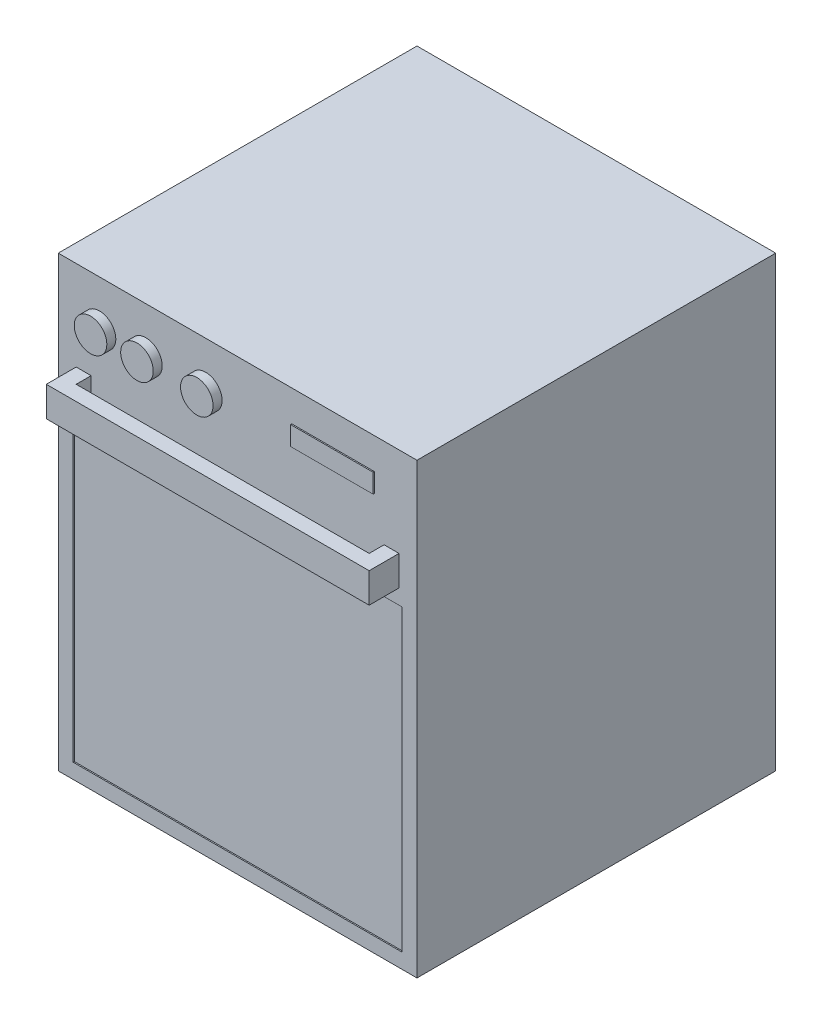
ISO-10303-21;
HEADER;
FILE_DESCRIPTION(('STEP AP214'),'2;1');
FILE_NAME('part.step','',(''),(''),'','','');
FILE_SCHEMA(('AUTOMOTIVE_DESIGN { 1 0 10303 214 1 1 1 1 }'));
ENDSEC;
DATA;
#1=APPLICATION_CONTEXT('core data for automotive mechanical design processes');
#2=APPLICATION_PROTOCOL_DEFINITION('international standard','automotive_design',2000,#1);
#3=PRODUCT_CONTEXT('',#1,'mechanical');
#4=PRODUCT('Part','Part','',(#3));
#5=PRODUCT_RELATED_PRODUCT_CATEGORY('part','',(#4));
#6=PRODUCT_DEFINITION_FORMATION('','',#4);
#7=PRODUCT_DEFINITION_CONTEXT('part definition',#1,'design');
#8=PRODUCT_DEFINITION('design','',#6,#7);
#9=PRODUCT_DEFINITION_SHAPE('','',#8);
#10=(LENGTH_UNIT() NAMED_UNIT(*) SI_UNIT(.MILLI.,.METRE.));
#11=(NAMED_UNIT(*) PLANE_ANGLE_UNIT() SI_UNIT($,.RADIAN.));
#12=(NAMED_UNIT(*) SI_UNIT($,.STERADIAN.) SOLID_ANGLE_UNIT());
#13=UNCERTAINTY_MEASURE_WITH_UNIT(LENGTH_MEASURE(1.E-05),#10,'distance_accuracy_value','');
#14=(GEOMETRIC_REPRESENTATION_CONTEXT(3) GLOBAL_UNCERTAINTY_ASSIGNED_CONTEXT((#13)) GLOBAL_UNIT_ASSIGNED_CONTEXT((#10,
#11,#12)) REPRESENTATION_CONTEXT('',''));
#15=CARTESIAN_POINT('',(0.,0.,0.));
#16=DIRECTION('',(0.,0.,1.));
#17=DIRECTION('',(1.,0.,0.));
#18=AXIS2_PLACEMENT_3D('',#15,#16,#17);
#19=CARTESIAN_POINT('',(0.,0.,600.));
#20=DIRECTION('',(0.,0.,-1.));
#21=DIRECTION('',(-1.,0.,0.));
#22=AXIS2_PLACEMENT_3D('',#19,#20,#21);
#23=PLANE('',#22);
#24=DIRECTION('',(1.,0.,0.));
#25=VECTOR('',#24,1.);
#26=CARTESIAN_POINT('',(30.,550.,600.));
#27=LINE('',#26,#25);
#28=CARTESIAN_POINT('',(545.,550.,600.));
#29=VERTEX_POINT('',#28);
#30=CARTESIAN_POINT('',(570.,550.,600.));
#31=VERTEX_POINT('',#30);
#32=EDGE_CURVE('E278',#29,#31,#27,.T.);
#33=ORIENTED_EDGE('',*,*,#32,.F.);
#34=DIRECTION('',(0.,1.,0.));
#35=VECTOR('',#34,1.);
#36=CARTESIAN_POINT('',(545.,550.,600.));
#37=LINE('',#36,#35);
#38=CARTESIAN_POINT('',(545.,600.,600.));
#39=VERTEX_POINT('',#38);
#40=EDGE_CURVE('E259',#29,#39,#37,.T.);
#41=ORIENTED_EDGE('',*,*,#40,.T.);
#42=DIRECTION('',(-1.,0.,0.));
#43=VECTOR('',#42,1.);
#44=CARTESIAN_POINT('',(30.,600.,600.));
#45=LINE('',#44,#43);
#46=CARTESIAN_POINT('',(570.,600.,600.));
#47=VERTEX_POINT('',#46);
#48=EDGE_CURVE('E269',#47,#39,#45,.T.);
#49=ORIENTED_EDGE('',*,*,#48,.F.);
#50=DIRECTION('',(0.,1.,0.));
#51=VECTOR('',#50,1.);
#52=CARTESIAN_POINT('',(570.,600.,600.));
#53=LINE('',#52,#51);
#54=EDGE_CURVE('E282',#31,#47,#53,.T.);
#55=ORIENTED_EDGE('',*,*,#54,.F.);
#56=EDGE_LOOP('',(#33,#41,#49,#55));
#57=FACE_BOUND('',#56,.T.);
#58=DIRECTION('',(0.,-1.,0.));
#59=VECTOR('',#58,1.);
#60=CARTESIAN_POINT('',(0.,0.,600.));
#61=LINE('',#60,#59);
#62=CARTESIAN_POINT('',(0.,750.,600.));
#63=VERTEX_POINT('',#62);
#64=CARTESIAN_POINT('',(0.,0.,600.));
#65=VERTEX_POINT('',#64);
#66=EDGE_CURVE('E300',#63,#65,#61,.T.);
#67=ORIENTED_EDGE('',*,*,#66,.T.);
#68=DIRECTION('',(1.,0.,0.));
#69=VECTOR('',#68,1.);
#70=CARTESIAN_POINT('',(0.,0.,600.));
#71=LINE('',#70,#69);
#72=CARTESIAN_POINT('',(600.,0.,600.));
#73=VERTEX_POINT('',#72);
#74=EDGE_CURVE('E303',#65,#73,#71,.T.);
#75=ORIENTED_EDGE('',*,*,#74,.T.);
#76=DIRECTION('',(0.,1.,0.));
#77=VECTOR('',#76,1.);
#78=CARTESIAN_POINT('',(600.,0.,600.));
#79=LINE('',#78,#77);
#80=CARTESIAN_POINT('',(600.,750.,600.));
#81=VERTEX_POINT('',#80);
#82=EDGE_CURVE('E306',#73,#81,#79,.T.);
#83=ORIENTED_EDGE('',*,*,#82,.T.);
#84=DIRECTION('',(-1.,0.,0.));
#85=VECTOR('',#84,1.);
#86=CARTESIAN_POINT('',(0.,750.,600.));
#87=LINE('',#86,#85);
#88=EDGE_CURVE('E308',#81,#63,#87,.T.);
#89=ORIENTED_EDGE('',*,*,#88,.T.);
#90=EDGE_LOOP('',(#67,#75,#83,#89));
#91=FACE_BOUND('',#90,.T.);
#92=DIRECTION('',(0.,1.,0.));
#93=VECTOR('',#92,1.);
#94=CARTESIAN_POINT('',(55.,550.,600.));
#95=LINE('',#94,#93);
#96=CARTESIAN_POINT('',(55.,550.,600.));
#97=VERTEX_POINT('',#96);
#98=CARTESIAN_POINT('',(55.,600.,600.));
#99=VERTEX_POINT('',#98);
#100=EDGE_CURVE('E256',#97,#99,#95,.T.);
#101=ORIENTED_EDGE('',*,*,#100,.F.);
#102=CARTESIAN_POINT('',(30.,550.,600.));
#103=VERTEX_POINT('',#102);
#104=EDGE_CURVE('E279',#103,#97,#27,.T.);
#105=ORIENTED_EDGE('',*,*,#104,.F.);
#106=DIRECTION('',(0.,-1.,0.));
#107=VECTOR('',#106,1.);
#108=CARTESIAN_POINT('',(30.,600.,600.));
#109=LINE('',#108,#107);
#110=CARTESIAN_POINT('',(30.,600.,600.));
#111=VERTEX_POINT('',#110);
#112=EDGE_CURVE('E258',#111,#103,#109,.T.);
#113=ORIENTED_EDGE('',*,*,#112,.F.);
#114=EDGE_CURVE('E285',#99,#111,#45,.T.);
#115=ORIENTED_EDGE('',*,*,#114,.F.);
#116=EDGE_LOOP('',(#101,#105,#113,#115));
#117=FACE_BOUND('',#116,.T.);
#118=DIRECTION('',(1.,0.,0.));
#119=VECTOR('',#118,1.);
#120=CARTESIAN_POINT('',(25.,25.,600.));
#121=LINE('',#120,#119);
#122=CARTESIAN_POINT('',(25.,25.,600.));
#123=VERTEX_POINT('',#122);
#124=CARTESIAN_POINT('',(575.,25.,600.));
#125=VERTEX_POINT('',#124);
#126=EDGE_CURVE('E222',#123,#125,#121,.T.);
#127=ORIENTED_EDGE('',*,*,#126,.F.);
#128=DIRECTION('',(0.,-1.,0.));
#129=VECTOR('',#128,1.);
#130=CARTESIAN_POINT('',(25.,525.,600.));
#131=LINE('',#130,#129);
#132=CARTESIAN_POINT('',(25.,525.,600.));
#133=VERTEX_POINT('',#132);
#134=EDGE_CURVE('E206',#133,#123,#131,.T.);
#135=ORIENTED_EDGE('',*,*,#134,.F.);
#136=DIRECTION('',(-1.,0.,0.));
#137=VECTOR('',#136,1.);
#138=CARTESIAN_POINT('',(25.,525.,600.));
#139=LINE('',#138,#137);
#140=CARTESIAN_POINT('',(575.,525.,600.));
#141=VERTEX_POINT('',#140);
#142=EDGE_CURVE('E211',#141,#133,#139,.T.);
#143=ORIENTED_EDGE('',*,*,#142,.F.);
#144=DIRECTION('',(0.,1.,0.));
#145=VECTOR('',#144,1.);
#146=CARTESIAN_POINT('',(575.,525.,600.));
#147=LINE('',#146,#145);
#148=EDGE_CURVE('E225',#125,#141,#147,.T.);
#149=ORIENTED_EDGE('',*,*,#148,.F.);
#150=EDGE_LOOP('',(#127,#135,#143,#149));
#151=FACE_BOUND('',#150,.T.);
#152=CARTESIAN_POINT('',(69.0093748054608,673.512739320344,600.));
#153=DIRECTION('',(0.,0.,-1.));
#154=DIRECTION('',(-1.,0.,0.));
#155=AXIS2_PLACEMENT_3D('',#152,#153,#154);
#156=CIRCLE('',#155,27.2365651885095);
#157=CARTESIAN_POINT('',(41.7728096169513,673.512739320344,600.));
#158=VERTEX_POINT('',#157);
#159=EDGE_CURVE('E329',#158,#158,#156,.F.);
#160=ORIENTED_EDGE('',*,*,#159,.F.);
#161=EDGE_LOOP('',(#160));
#162=FACE_BOUND('',#161,.T.);
#163=CARTESIAN_POINT('',(146.635573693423,673.512739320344,600.));
#164=DIRECTION('',(0.,0.,-1.));
#165=DIRECTION('',(-1.,0.,0.));
#166=AXIS2_PLACEMENT_3D('',#163,#164,#165);
#167=CIRCLE('',#166,27.2365651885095);
#168=CARTESIAN_POINT('',(119.399008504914,673.512739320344,600.));
#169=VERTEX_POINT('',#168);
#170=EDGE_CURVE('E42',#169,#169,#167,.F.);
#171=ORIENTED_EDGE('',*,*,#170,.F.);
#172=EDGE_LOOP('',(#171));
#173=FACE_BOUND('',#172,.T.);
#174=CARTESIAN_POINT('',(246.747834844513,673.512739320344,600.));
#175=DIRECTION('',(0.,0.,-1.));
#176=DIRECTION('',(-1.,0.,0.));
#177=AXIS2_PLACEMENT_3D('',#174,#175,#176);
#178=CIRCLE('',#177,27.2365651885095);
#179=CARTESIAN_POINT('',(219.511269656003,673.512739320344,600.));
#180=VERTEX_POINT('',#179);
#181=EDGE_CURVE('E11',#180,#180,#178,.F.);
#182=ORIENTED_EDGE('',*,*,#181,.F.);
#183=EDGE_LOOP('',(#182));
#184=FACE_BOUND('',#183,.T.);
#185=DIRECTION('',(0.,1.,0.));
#186=VECTOR('',#185,1.);
#187=CARTESIAN_POINT('',(528.716800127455,666.12290980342,600.));
#188=LINE('',#187,#186);
#189=CARTESIAN_POINT('',(528.716800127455,666.12290980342,600.));
#190=VERTEX_POINT('',#189);
#191=CARTESIAN_POINT('',(528.716800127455,697.939027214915,600.));
#192=VERTEX_POINT('',#191);
#193=EDGE_CURVE('E191',#190,#192,#188,.T.);
#194=ORIENTED_EDGE('',*,*,#193,.F.);
#195=DIRECTION('',(1.,0.,0.));
#196=VECTOR('',#195,1.);
#197=CARTESIAN_POINT('',(528.716800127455,666.12290980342,600.));
#198=LINE('',#197,#196);
#199=CARTESIAN_POINT('',(390.332790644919,666.12290980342,600.));
#200=VERTEX_POINT('',#199);
#201=EDGE_CURVE('E188',#200,#190,#198,.T.);
#202=ORIENTED_EDGE('',*,*,#201,.F.);
#203=DIRECTION('',(0.,-1.,0.));
#204=VECTOR('',#203,1.);
#205=CARTESIAN_POINT('',(390.332790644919,666.12290980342,600.));
#206=LINE('',#205,#204);
#207=CARTESIAN_POINT('',(390.332790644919,697.939027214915,600.));
#208=VERTEX_POINT('',#207);
#209=EDGE_CURVE('E54',#208,#200,#206,.T.);
#210=ORIENTED_EDGE('',*,*,#209,.F.);
#211=DIRECTION('',(-1.,0.,0.));
#212=VECTOR('',#211,1.);
#213=CARTESIAN_POINT('',(528.716800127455,697.939027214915,600.));
#214=LINE('',#213,#212);
#215=EDGE_CURVE('E49',#192,#208,#214,.T.);
#216=ORIENTED_EDGE('',*,*,#215,.F.);
#217=EDGE_LOOP('',(#194,#202,#210,#216));
#218=FACE_BOUND('',#217,.T.);
#219=ADVANCED_FACE('F34',(#57,#91,#117,#151,#162,#173,#184,#218),#23,.F.);
#220=CARTESIAN_POINT('',(0.,0.,600.));
#221=DIRECTION('',(1.,0.,0.));
#222=DIRECTION('',(0.,0.,-1.));
#223=AXIS2_PLACEMENT_3D('',#220,#221,#222);
#224=PLANE('',#223);
#225=DIRECTION('',(0.,-1.,0.));
#226=VECTOR('',#225,1.);
#227=CARTESIAN_POINT('',(0.,0.,0.));
#228=LINE('',#227,#226);
#229=CARTESIAN_POINT('',(0.,750.,0.));
#230=VERTEX_POINT('',#229);
#231=CARTESIAN_POINT('',(0.,0.,0.));
#232=VERTEX_POINT('',#231);
#233=EDGE_CURVE('E299',#230,#232,#228,.T.);
#234=ORIENTED_EDGE('',*,*,#233,.T.);
#235=DIRECTION('',(0.,0.,-1.));
#236=VECTOR('',#235,1.);
#237=CARTESIAN_POINT('',(0.,0.,600.));
#238=LINE('',#237,#236);
#239=EDGE_CURVE('E326',#65,#232,#238,.T.);
#240=ORIENTED_EDGE('',*,*,#239,.F.);
#241=ORIENTED_EDGE('',*,*,#66,.F.);
#242=DIRECTION('',(0.,0.,-1.));
#243=VECTOR('',#242,1.);
#244=CARTESIAN_POINT('',(0.,750.,600.));
#245=LINE('',#244,#243);
#246=EDGE_CURVE('E310',#63,#230,#245,.T.);
#247=ORIENTED_EDGE('',*,*,#246,.T.);
#248=EDGE_LOOP('',(#234,#240,#241,#247));
#249=FACE_BOUND('',#248,.T.);
#250=ADVANCED_FACE('F36',(#249),#224,.F.);
#251=CARTESIAN_POINT('',(0.,0.,600.));
#252=DIRECTION('',(0.,1.,0.));
#253=DIRECTION('',(0.,0.,1.));
#254=AXIS2_PLACEMENT_3D('',#251,#252,#253);
#255=PLANE('',#254);
#256=DIRECTION('',(1.,0.,0.));
#257=VECTOR('',#256,1.);
#258=CARTESIAN_POINT('',(0.,0.,0.));
#259=LINE('',#258,#257);
#260=CARTESIAN_POINT('',(600.,0.,0.));
#261=VERTEX_POINT('',#260);
#262=EDGE_CURVE('E313',#232,#261,#259,.T.);
#263=ORIENTED_EDGE('',*,*,#262,.T.);
#264=DIRECTION('',(0.,0.,-1.));
#265=VECTOR('',#264,1.);
#266=CARTESIAN_POINT('',(600.,0.,600.));
#267=LINE('',#266,#265);
#268=EDGE_CURVE('E323',#73,#261,#267,.T.);
#269=ORIENTED_EDGE('',*,*,#268,.F.);
#270=ORIENTED_EDGE('',*,*,#74,.F.);
#271=ORIENTED_EDGE('',*,*,#239,.T.);
#272=EDGE_LOOP('',(#263,#269,#270,#271));
#273=FACE_BOUND('',#272,.T.);
#274=ADVANCED_FACE('F453',(#273),#255,.F.);
#275=CARTESIAN_POINT('',(600.,0.,600.));
#276=DIRECTION('',(-1.,0.,0.));
#277=DIRECTION('',(0.,0.,1.));
#278=AXIS2_PLACEMENT_3D('',#275,#276,#277);
#279=PLANE('',#278);
#280=DIRECTION('',(0.,1.,0.));
#281=VECTOR('',#280,1.);
#282=CARTESIAN_POINT('',(600.,0.,0.));
#283=LINE('',#282,#281);
#284=CARTESIAN_POINT('',(600.,750.,0.));
#285=VERTEX_POINT('',#284);
#286=EDGE_CURVE('E315',#261,#285,#283,.T.);
#287=ORIENTED_EDGE('',*,*,#286,.T.);
#288=DIRECTION('',(0.,0.,-1.));
#289=VECTOR('',#288,1.);
#290=CARTESIAN_POINT('',(600.,750.,600.));
#291=LINE('',#290,#289);
#292=EDGE_CURVE('E320',#81,#285,#291,.T.);
#293=ORIENTED_EDGE('',*,*,#292,.F.);
#294=ORIENTED_EDGE('',*,*,#82,.F.);
#295=ORIENTED_EDGE('',*,*,#268,.T.);
#296=EDGE_LOOP('',(#287,#293,#294,#295));
#297=FACE_BOUND('',#296,.T.);
#298=ADVANCED_FACE('F450',(#297),#279,.F.);
#299=CARTESIAN_POINT('',(0.,750.,600.));
#300=DIRECTION('',(0.,-1.,0.));
#301=DIRECTION('',(0.,0.,-1.));
#302=AXIS2_PLACEMENT_3D('',#299,#300,#301);
#303=PLANE('',#302);
#304=DIRECTION('',(-1.,0.,0.));
#305=VECTOR('',#304,1.);
#306=CARTESIAN_POINT('',(0.,750.,0.));
#307=LINE('',#306,#305);
#308=EDGE_CURVE('E304',#285,#230,#307,.T.);
#309=ORIENTED_EDGE('',*,*,#308,.T.);
#310=ORIENTED_EDGE('',*,*,#246,.F.);
#311=ORIENTED_EDGE('',*,*,#88,.F.);
#312=ORIENTED_EDGE('',*,*,#292,.T.);
#313=EDGE_LOOP('',(#309,#310,#311,#312));
#314=FACE_BOUND('',#313,.T.);
#315=ADVANCED_FACE('F446',(#314),#303,.F.);
#316=CARTESIAN_POINT('',(0.,0.,0.));
#317=DIRECTION('',(0.,0.,-1.));
#318=DIRECTION('',(-1.,0.,0.));
#319=AXIS2_PLACEMENT_3D('',#316,#317,#318);
#320=PLANE('',#319);
#321=ORIENTED_EDGE('',*,*,#233,.F.);
#322=ORIENTED_EDGE('',*,*,#308,.F.);
#323=ORIENTED_EDGE('',*,*,#286,.F.);
#324=ORIENTED_EDGE('',*,*,#262,.F.);
#325=EDGE_LOOP('',(#321,#322,#323,#324));
#326=FACE_BOUND('',#325,.T.);
#327=ADVANCED_FACE('F441',(#326),#320,.T.);
#328=CARTESIAN_POINT('',(30.,600.,650.));
#329=DIRECTION('',(1.,0.,0.));
#330=DIRECTION('',(0.,1.,0.));
#331=AXIS2_PLACEMENT_3D('',#328,#329,#330);
#332=PLANE('',#331);
#333=ORIENTED_EDGE('',*,*,#112,.T.);
#334=DIRECTION('',(0.,0.,-1.));
#335=VECTOR('',#334,1.);
#336=CARTESIAN_POINT('',(30.,550.,650.));
#337=LINE('',#336,#335);
#338=CARTESIAN_POINT('',(30.,550.,650.));
#339=VERTEX_POINT('',#338);
#340=EDGE_CURVE('E296',#339,#103,#337,.T.);
#341=ORIENTED_EDGE('',*,*,#340,.F.);
#342=DIRECTION('',(0.,-1.,0.));
#343=VECTOR('',#342,1.);
#344=CARTESIAN_POINT('',(30.,600.,650.));
#345=LINE('',#344,#343);
#346=CARTESIAN_POINT('',(30.,600.,650.));
#347=VERTEX_POINT('',#346);
#348=EDGE_CURVE('E265',#347,#339,#345,.T.);
#349=ORIENTED_EDGE('',*,*,#348,.F.);
#350=DIRECTION('',(0.,0.,-1.));
#351=VECTOR('',#350,1.);
#352=CARTESIAN_POINT('',(30.,600.,650.));
#353=LINE('',#352,#351);
#354=EDGE_CURVE('E275',#347,#111,#353,.T.);
#355=ORIENTED_EDGE('',*,*,#354,.T.);
#356=EDGE_LOOP('',(#333,#341,#349,#355));
#357=FACE_BOUND('',#356,.T.);
#358=ADVANCED_FACE('F438',(#357),#332,.F.);
#359=CARTESIAN_POINT('',(30.,550.,650.));
#360=DIRECTION('',(0.,1.,0.));
#361=DIRECTION('',(0.,0.,1.));
#362=AXIS2_PLACEMENT_3D('',#359,#360,#361);
#363=PLANE('',#362);
#364=ORIENTED_EDGE('',*,*,#104,.T.);
#365=DIRECTION('',(0.,0.,1.));
#366=VECTOR('',#365,1.);
#367=CARTESIAN_POINT('',(55.,550.,600.));
#368=LINE('',#367,#366);
#369=CARTESIAN_POINT('',(55.,550.,625.));
#370=VERTEX_POINT('',#369);
#371=EDGE_CURVE('E239',#97,#370,#368,.T.);
#372=ORIENTED_EDGE('',*,*,#371,.T.);
#373=DIRECTION('',(1.,0.,0.));
#374=VECTOR('',#373,1.);
#375=CARTESIAN_POINT('',(55.,550.,625.));
#376=LINE('',#375,#374);
#377=CARTESIAN_POINT('',(545.,550.,625.));
#378=VERTEX_POINT('',#377);
#379=EDGE_CURVE('E242',#370,#378,#376,.T.);
#380=ORIENTED_EDGE('',*,*,#379,.T.);
#381=DIRECTION('',(0.,0.,-1.));
#382=VECTOR('',#381,1.);
#383=CARTESIAN_POINT('',(545.,550.,600.));
#384=LINE('',#383,#382);
#385=EDGE_CURVE('E246',#378,#29,#384,.T.);
#386=ORIENTED_EDGE('',*,*,#385,.T.);
#387=ORIENTED_EDGE('',*,*,#32,.T.);
#388=DIRECTION('',(0.,0.,-1.));
#389=VECTOR('',#388,1.);
#390=CARTESIAN_POINT('',(570.,550.,650.));
#391=LINE('',#390,#389);
#392=CARTESIAN_POINT('',(570.,550.,650.));
#393=VERTEX_POINT('',#392);
#394=EDGE_CURVE('E293',#393,#31,#391,.T.);
#395=ORIENTED_EDGE('',*,*,#394,.F.);
#396=DIRECTION('',(1.,0.,0.));
#397=VECTOR('',#396,1.);
#398=CARTESIAN_POINT('',(30.,550.,650.));
#399=LINE('',#398,#397);
#400=EDGE_CURVE('E268',#339,#393,#399,.T.);
#401=ORIENTED_EDGE('',*,*,#400,.F.);
#402=ORIENTED_EDGE('',*,*,#340,.T.);
#403=EDGE_LOOP('',(#364,#372,#380,#386,#387,#395,#401,#402));
#404=FACE_BOUND('',#403,.T.);
#405=ADVANCED_FACE('F434',(#404),#363,.F.);
#406=CARTESIAN_POINT('',(570.,600.,650.));
#407=DIRECTION('',(-1.,0.,0.));
#408=DIRECTION('',(0.,0.,1.));
#409=AXIS2_PLACEMENT_3D('',#406,#407,#408);
#410=PLANE('',#409);
#411=ORIENTED_EDGE('',*,*,#54,.T.);
#412=DIRECTION('',(0.,0.,-1.));
#413=VECTOR('',#412,1.);
#414=CARTESIAN_POINT('',(570.,600.,650.));
#415=LINE('',#414,#413);
#416=CARTESIAN_POINT('',(570.,600.,650.));
#417=VERTEX_POINT('',#416);
#418=EDGE_CURVE('E290',#417,#47,#415,.T.);
#419=ORIENTED_EDGE('',*,*,#418,.F.);
#420=DIRECTION('',(0.,1.,0.));
#421=VECTOR('',#420,1.);
#422=CARTESIAN_POINT('',(570.,600.,650.));
#423=LINE('',#422,#421);
#424=EDGE_CURVE('E271',#393,#417,#423,.T.);
#425=ORIENTED_EDGE('',*,*,#424,.F.);
#426=ORIENTED_EDGE('',*,*,#394,.T.);
#427=EDGE_LOOP('',(#411,#419,#425,#426));
#428=FACE_BOUND('',#427,.T.);
#429=ADVANCED_FACE('F430',(#428),#410,.F.);
#430=CARTESIAN_POINT('',(30.,600.,650.));
#431=DIRECTION('',(0.,-1.,0.));
#432=DIRECTION('',(0.,0.,-1.));
#433=AXIS2_PLACEMENT_3D('',#430,#431,#432);
#434=PLANE('',#433);
#435=DIRECTION('',(1.,0.,0.));
#436=VECTOR('',#435,1.);
#437=CARTESIAN_POINT('',(55.,600.,625.));
#438=LINE('',#437,#436);
#439=CARTESIAN_POINT('',(55.,600.,625.));
#440=VERTEX_POINT('',#439);
#441=CARTESIAN_POINT('',(545.,600.,625.));
#442=VERTEX_POINT('',#441);
#443=EDGE_CURVE('E251',#440,#442,#438,.T.);
#444=ORIENTED_EDGE('',*,*,#443,.F.);
#445=DIRECTION('',(0.,0.,1.));
#446=VECTOR('',#445,1.);
#447=CARTESIAN_POINT('',(55.,600.,600.));
#448=LINE('',#447,#446);
#449=EDGE_CURVE('E232',#99,#440,#448,.T.);
#450=ORIENTED_EDGE('',*,*,#449,.F.);
#451=ORIENTED_EDGE('',*,*,#114,.T.);
#452=ORIENTED_EDGE('',*,*,#354,.F.);
#453=DIRECTION('',(-1.,0.,0.));
#454=VECTOR('',#453,1.);
#455=CARTESIAN_POINT('',(30.,600.,650.));
#456=LINE('',#455,#454);
#457=EDGE_CURVE('E273',#417,#347,#456,.T.);
#458=ORIENTED_EDGE('',*,*,#457,.F.);
#459=ORIENTED_EDGE('',*,*,#418,.T.);
#460=ORIENTED_EDGE('',*,*,#48,.T.);
#461=DIRECTION('',(0.,0.,-1.));
#462=VECTOR('',#461,1.);
#463=CARTESIAN_POINT('',(545.,600.,600.));
#464=LINE('',#463,#462);
#465=EDGE_CURVE('E243',#442,#39,#464,.T.);
#466=ORIENTED_EDGE('',*,*,#465,.F.);
#467=EDGE_LOOP('',(#444,#450,#451,#452,#458,#459,#460,#466));
#468=FACE_BOUND('',#467,.T.);
#469=ADVANCED_FACE('F426',(#468),#434,.F.);
#470=CARTESIAN_POINT('',(0.,0.,650.));
#471=DIRECTION('',(0.,0.,1.));
#472=DIRECTION('',(1.,0.,0.));
#473=AXIS2_PLACEMENT_3D('',#470,#471,#472);
#474=PLANE('',#473);
#475=ORIENTED_EDGE('',*,*,#348,.T.);
#476=ORIENTED_EDGE('',*,*,#400,.T.);
#477=ORIENTED_EDGE('',*,*,#424,.T.);
#478=ORIENTED_EDGE('',*,*,#457,.T.);
#479=EDGE_LOOP('',(#475,#476,#477,#478));
#480=FACE_BOUND('',#479,.T.);
#481=ADVANCED_FACE('F422',(#480),#474,.T.);
#482=CARTESIAN_POINT('',(55.,550.,600.));
#483=DIRECTION('',(-1.,0.,0.));
#484=DIRECTION('',(0.,0.,1.));
#485=AXIS2_PLACEMENT_3D('',#482,#483,#484);
#486=PLANE('',#485);
#487=ORIENTED_EDGE('',*,*,#449,.T.);
#488=DIRECTION('',(0.,1.,0.));
#489=VECTOR('',#488,1.);
#490=CARTESIAN_POINT('',(55.,550.,625.));
#491=LINE('',#490,#489);
#492=EDGE_CURVE('E249',#370,#440,#491,.T.);
#493=ORIENTED_EDGE('',*,*,#492,.F.);
#494=ORIENTED_EDGE('',*,*,#371,.F.);
#495=ORIENTED_EDGE('',*,*,#100,.T.);
#496=EDGE_LOOP('',(#487,#493,#494,#495));
#497=FACE_BOUND('',#496,.T.);
#498=ADVANCED_FACE('F415',(#497),#486,.F.);
#499=CARTESIAN_POINT('',(545.,550.,600.));
#500=DIRECTION('',(1.,0.,0.));
#501=DIRECTION('',(0.,0.,-1.));
#502=AXIS2_PLACEMENT_3D('',#499,#500,#501);
#503=PLANE('',#502);
#504=ORIENTED_EDGE('',*,*,#465,.T.);
#505=ORIENTED_EDGE('',*,*,#40,.F.);
#506=ORIENTED_EDGE('',*,*,#385,.F.);
#507=DIRECTION('',(0.,1.,0.));
#508=VECTOR('',#507,1.);
#509=CARTESIAN_POINT('',(545.,550.,625.));
#510=LINE('',#509,#508);
#511=EDGE_CURVE('E261',#378,#442,#510,.T.);
#512=ORIENTED_EDGE('',*,*,#511,.T.);
#513=EDGE_LOOP('',(#504,#505,#506,#512));
#514=FACE_BOUND('',#513,.T.);
#515=ADVANCED_FACE('F412',(#514),#503,.F.);
#516=CARTESIAN_POINT('',(55.,550.,625.));
#517=DIRECTION('',(0.,0.,1.));
#518=DIRECTION('',(1.,0.,0.));
#519=AXIS2_PLACEMENT_3D('',#516,#517,#518);
#520=PLANE('',#519);
#521=ORIENTED_EDGE('',*,*,#443,.T.);
#522=ORIENTED_EDGE('',*,*,#511,.F.);
#523=ORIENTED_EDGE('',*,*,#379,.F.);
#524=ORIENTED_EDGE('',*,*,#492,.T.);
#525=EDGE_LOOP('',(#521,#522,#523,#524));
#526=FACE_BOUND('',#525,.T.);
#527=ADVANCED_FACE('F410',(#526),#520,.F.);
#528=CARTESIAN_POINT('',(25.,525.,598.));
#529=DIRECTION('',(-1.,0.,0.));
#530=DIRECTION('',(0.,-1.,0.));
#531=AXIS2_PLACEMENT_3D('',#528,#529,#530);
#532=PLANE('',#531);
#533=ORIENTED_EDGE('',*,*,#134,.T.);
#534=DIRECTION('',(0.,0.,1.));
#535=VECTOR('',#534,1.);
#536=CARTESIAN_POINT('',(25.,25.,598.));
#537=LINE('',#536,#535);
#538=CARTESIAN_POINT('',(25.,25.,598.));
#539=VERTEX_POINT('',#538);
#540=EDGE_CURVE('E220',#539,#123,#537,.T.);
#541=ORIENTED_EDGE('',*,*,#540,.F.);
#542=DIRECTION('',(0.,-1.,0.));
#543=VECTOR('',#542,1.);
#544=CARTESIAN_POINT('',(25.,525.,598.));
#545=LINE('',#544,#543);
#546=CARTESIAN_POINT('',(25.,525.,598.));
#547=VERTEX_POINT('',#546);
#548=EDGE_CURVE('E207',#547,#539,#545,.T.);
#549=ORIENTED_EDGE('',*,*,#548,.F.);
#550=DIRECTION('',(0.,0.,1.));
#551=VECTOR('',#550,1.);
#552=CARTESIAN_POINT('',(25.,525.,598.));
#553=LINE('',#552,#551);
#554=EDGE_CURVE('E230',#547,#133,#553,.T.);
#555=ORIENTED_EDGE('',*,*,#554,.T.);
#556=EDGE_LOOP('',(#533,#541,#549,#555));
#557=FACE_BOUND('',#556,.T.);
#558=ADVANCED_FACE('F400',(#557),#532,.F.);
#559=CARTESIAN_POINT('',(25.,525.,598.));
#560=DIRECTION('',(0.,1.,0.));
#561=DIRECTION('',(0.,0.,1.));
#562=AXIS2_PLACEMENT_3D('',#559,#560,#561);
#563=PLANE('',#562);
#564=ORIENTED_EDGE('',*,*,#142,.T.);
#565=ORIENTED_EDGE('',*,*,#554,.F.);
#566=DIRECTION('',(-1.,0.,0.));
#567=VECTOR('',#566,1.);
#568=CARTESIAN_POINT('',(25.,525.,598.));
#569=LINE('',#568,#567);
#570=CARTESIAN_POINT('',(575.,525.,598.));
#571=VERTEX_POINT('',#570);
#572=EDGE_CURVE('E217',#571,#547,#569,.T.);
#573=ORIENTED_EDGE('',*,*,#572,.F.);
#574=DIRECTION('',(0.,0.,1.));
#575=VECTOR('',#574,1.);
#576=CARTESIAN_POINT('',(575.,525.,598.));
#577=LINE('',#576,#575);
#578=EDGE_CURVE('E233',#571,#141,#577,.T.);
#579=ORIENTED_EDGE('',*,*,#578,.T.);
#580=EDGE_LOOP('',(#564,#565,#573,#579));
#581=FACE_BOUND('',#580,.T.);
#582=ADVANCED_FACE('F396',(#581),#563,.F.);
#583=CARTESIAN_POINT('',(575.,525.,598.));
#584=DIRECTION('',(1.,0.,0.));
#585=DIRECTION('',(0.,0.,-1.));
#586=AXIS2_PLACEMENT_3D('',#583,#584,#585);
#587=PLANE('',#586);
#588=ORIENTED_EDGE('',*,*,#148,.T.);
#589=ORIENTED_EDGE('',*,*,#578,.F.);
#590=DIRECTION('',(0.,1.,0.));
#591=VECTOR('',#590,1.);
#592=CARTESIAN_POINT('',(575.,525.,598.));
#593=LINE('',#592,#591);
#594=CARTESIAN_POINT('',(575.,25.,598.));
#595=VERTEX_POINT('',#594);
#596=EDGE_CURVE('E214',#595,#571,#593,.T.);
#597=ORIENTED_EDGE('',*,*,#596,.F.);
#598=DIRECTION('',(0.,0.,1.));
#599=VECTOR('',#598,1.);
#600=CARTESIAN_POINT('',(575.,25.,598.));
#601=LINE('',#600,#599);
#602=EDGE_CURVE('E235',#595,#125,#601,.T.);
#603=ORIENTED_EDGE('',*,*,#602,.T.);
#604=EDGE_LOOP('',(#588,#589,#597,#603));
#605=FACE_BOUND('',#604,.T.);
#606=ADVANCED_FACE('F399',(#605),#587,.F.);
#607=CARTESIAN_POINT('',(25.,25.,598.));
#608=DIRECTION('',(0.,-1.,0.));
#609=DIRECTION('',(0.,0.,-1.));
#610=AXIS2_PLACEMENT_3D('',#607,#608,#609);
#611=PLANE('',#610);
#612=ORIENTED_EDGE('',*,*,#126,.T.);
#613=ORIENTED_EDGE('',*,*,#602,.F.);
#614=DIRECTION('',(1.,0.,0.));
#615=VECTOR('',#614,1.);
#616=CARTESIAN_POINT('',(25.,25.,598.));
#617=LINE('',#616,#615);
#618=EDGE_CURVE('E210',#539,#595,#617,.T.);
#619=ORIENTED_EDGE('',*,*,#618,.F.);
#620=ORIENTED_EDGE('',*,*,#540,.T.);
#621=EDGE_LOOP('',(#612,#613,#619,#620));
#622=FACE_BOUND('',#621,.T.);
#623=ADVANCED_FACE('F394',(#622),#611,.F.);
#624=CARTESIAN_POINT('',(0.,0.,598.));
#625=DIRECTION('',(0.,0.,1.));
#626=DIRECTION('',(1.,0.,0.));
#627=AXIS2_PLACEMENT_3D('',#624,#625,#626);
#628=PLANE('',#627);
#629=ORIENTED_EDGE('',*,*,#548,.T.);
#630=ORIENTED_EDGE('',*,*,#618,.T.);
#631=ORIENTED_EDGE('',*,*,#596,.T.);
#632=ORIENTED_EDGE('',*,*,#572,.T.);
#633=EDGE_LOOP('',(#629,#630,#631,#632));
#634=FACE_BOUND('',#633,.T.);
#635=ADVANCED_FACE('F390',(#634),#628,.T.);
#636=CARTESIAN_POINT('',(69.0093748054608,673.512739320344,615.));
#637=DIRECTION('',(0.,0.,-1.));
#638=DIRECTION('',(-1.,0.,0.));
#639=AXIS2_PLACEMENT_3D('',#636,#637,#638);
#640=CYLINDRICAL_SURFACE('',#639,27.2365651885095);
#641=CARTESIAN_POINT('',(69.0093748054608,673.512739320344,615.));
#642=DIRECTION('',(0.,0.,1.));
#643=DIRECTION('',(1.,0.,0.));
#644=AXIS2_PLACEMENT_3D('',#641,#642,#643);
#645=CIRCLE('',#644,27.2365651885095);
#646=CARTESIAN_POINT('',(96.2459399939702,673.512739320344,615.));
#647=VERTEX_POINT('',#646);
#648=EDGE_CURVE('E203',#647,#647,#645,.T.);
#649=ORIENTED_EDGE('',*,*,#648,.F.);
#650=EDGE_LOOP('',(#649));
#651=FACE_BOUND('',#650,.T.);
#652=ORIENTED_EDGE('',*,*,#159,.T.);
#653=EDGE_LOOP('',(#652));
#654=FACE_BOUND('',#653,.T.);
#655=ADVANCED_FACE('F386',(#651,#654),#640,.T.);
#656=CARTESIAN_POINT('',(69.0093748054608,673.512739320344,615.));
#657=DIRECTION('',(0.,0.,1.));
#658=DIRECTION('',(1.,0.,0.));
#659=AXIS2_PLACEMENT_3D('',#656,#657,#658);
#660=PLANE('',#659);
#661=ORIENTED_EDGE('',*,*,#648,.T.);
#662=EDGE_LOOP('',(#661));
#663=FACE_BOUND('',#662,.T.);
#664=ADVANCED_FACE('F382',(#663),#660,.T.);
#665=CARTESIAN_POINT('',(146.635573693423,673.512739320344,615.));
#666=DIRECTION('',(0.,0.,-1.));
#667=DIRECTION('',(-1.,0.,0.));
#668=AXIS2_PLACEMENT_3D('',#665,#666,#667);
#669=CYLINDRICAL_SURFACE('',#668,27.2365651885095);
#670=CARTESIAN_POINT('',(146.635573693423,673.512739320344,615.));
#671=DIRECTION('',(0.,0.,1.));
#672=DIRECTION('',(1.,0.,0.));
#673=AXIS2_PLACEMENT_3D('',#670,#671,#672);
#674=CIRCLE('',#673,27.2365651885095);
#675=CARTESIAN_POINT('',(173.872138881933,673.512739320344,615.));
#676=VERTEX_POINT('',#675);
#677=EDGE_CURVE('E195',#676,#676,#674,.T.);
#678=ORIENTED_EDGE('',*,*,#677,.F.);
#679=EDGE_LOOP('',(#678));
#680=FACE_BOUND('',#679,.T.);
#681=ORIENTED_EDGE('',*,*,#170,.T.);
#682=EDGE_LOOP('',(#681));
#683=FACE_BOUND('',#682,.T.);
#684=ADVANCED_FACE('F334',(#680,#683),#669,.T.);
#685=CARTESIAN_POINT('',(146.635573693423,673.512739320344,615.));
#686=DIRECTION('',(0.,0.,1.));
#687=DIRECTION('',(1.,0.,0.));
#688=AXIS2_PLACEMENT_3D('',#685,#686,#687);
#689=PLANE('',#688);
#690=ORIENTED_EDGE('',*,*,#677,.T.);
#691=EDGE_LOOP('',(#690));
#692=FACE_BOUND('',#691,.T.);
#693=ADVANCED_FACE('F375',(#692),#689,.T.);
#694=CARTESIAN_POINT('',(246.747834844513,673.512739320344,615.));
#695=DIRECTION('',(0.,0.,-1.));
#696=DIRECTION('',(-1.,0.,0.));
#697=AXIS2_PLACEMENT_3D('',#694,#695,#696);
#698=CYLINDRICAL_SURFACE('',#697,27.2365651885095);
#699=CARTESIAN_POINT('',(246.747834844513,673.512739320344,615.));
#700=DIRECTION('',(0.,0.,1.));
#701=DIRECTION('',(1.,0.,0.));
#702=AXIS2_PLACEMENT_3D('',#699,#700,#701);
#703=CIRCLE('',#702,27.2365651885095);
#704=CARTESIAN_POINT('',(273.984400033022,673.512739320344,615.));
#705=VERTEX_POINT('',#704);
#706=EDGE_CURVE('E192',#705,#705,#703,.T.);
#707=ORIENTED_EDGE('',*,*,#706,.F.);
#708=EDGE_LOOP('',(#707));
#709=FACE_BOUND('',#708,.T.);
#710=ORIENTED_EDGE('',*,*,#181,.T.);
#711=EDGE_LOOP('',(#710));
#712=FACE_BOUND('',#711,.T.);
#713=ADVANCED_FACE('F371',(#709,#712),#698,.T.);
#714=CARTESIAN_POINT('',(246.747834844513,673.512739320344,615.));
#715=DIRECTION('',(0.,0.,1.));
#716=DIRECTION('',(1.,0.,0.));
#717=AXIS2_PLACEMENT_3D('',#714,#715,#716);
#718=PLANE('',#717);
#719=ORIENTED_EDGE('',*,*,#706,.T.);
#720=EDGE_LOOP('',(#719));
#721=FACE_BOUND('',#720,.T.);
#722=ADVANCED_FACE('F368',(#721),#718,.T.);
#723=CARTESIAN_POINT('',(528.716800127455,666.12290980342,602.));
#724=DIRECTION('',(-1.,0.,0.));
#725=DIRECTION('',(0.,0.,1.));
#726=AXIS2_PLACEMENT_3D('',#723,#724,#725);
#727=PLANE('',#726);
#728=ORIENTED_EDGE('',*,*,#193,.T.);
#729=DIRECTION('',(0.,0.,-1.));
#730=VECTOR('',#729,1.);
#731=CARTESIAN_POINT('',(528.716800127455,697.939027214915,602.));
#732=LINE('',#731,#730);
#733=CARTESIAN_POINT('',(528.716800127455,697.939027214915,602.));
#734=VERTEX_POINT('',#733);
#735=EDGE_CURVE('E172',#734,#192,#732,.T.);
#736=ORIENTED_EDGE('',*,*,#735,.F.);
#737=DIRECTION('',(0.,1.,0.));
#738=VECTOR('',#737,1.);
#739=CARTESIAN_POINT('',(528.716800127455,666.12290980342,602.));
#740=LINE('',#739,#738);
#741=CARTESIAN_POINT('',(528.716800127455,666.12290980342,602.));
#742=VERTEX_POINT('',#741);
#743=EDGE_CURVE('E179',#742,#734,#740,.T.);
#744=ORIENTED_EDGE('',*,*,#743,.F.);
#745=DIRECTION('',(0.,0.,-1.));
#746=VECTOR('',#745,1.);
#747=CARTESIAN_POINT('',(528.716800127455,666.12290980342,602.));
#748=LINE('',#747,#746);
#749=EDGE_CURVE('E346',#742,#190,#748,.T.);
#750=ORIENTED_EDGE('',*,*,#749,.T.);
#751=EDGE_LOOP('',(#728,#736,#744,#750));
#752=FACE_BOUND('',#751,.T.);
#753=ADVANCED_FACE('F190',(#752),#727,.F.);
#754=CARTESIAN_POINT('',(528.716800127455,697.939027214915,602.));
#755=DIRECTION('',(0.,-1.,0.));
#756=DIRECTION('',(0.,0.,-1.));
#757=AXIS2_PLACEMENT_3D('',#754,#755,#756);
#758=PLANE('',#757);
#759=ORIENTED_EDGE('',*,*,#215,.T.);
#760=DIRECTION('',(0.,0.,-1.));
#761=VECTOR('',#760,1.);
#762=CARTESIAN_POINT('',(390.332790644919,697.939027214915,602.));
#763=LINE('',#762,#761);
#764=CARTESIAN_POINT('',(390.332790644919,697.939027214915,602.));
#765=VERTEX_POINT('',#764);
#766=EDGE_CURVE('E175',#765,#208,#763,.T.);
#767=ORIENTED_EDGE('',*,*,#766,.F.);
#768=DIRECTION('',(-1.,0.,0.));
#769=VECTOR('',#768,1.);
#770=CARTESIAN_POINT('',(528.716800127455,697.939027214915,602.));
#771=LINE('',#770,#769);
#772=EDGE_CURVE('E168',#734,#765,#771,.T.);
#773=ORIENTED_EDGE('',*,*,#772,.F.);
#774=ORIENTED_EDGE('',*,*,#735,.T.);
#775=EDGE_LOOP('',(#759,#767,#773,#774));
#776=FACE_BOUND('',#775,.T.);
#777=ADVANCED_FACE('F170',(#776),#758,.F.);
#778=CARTESIAN_POINT('',(390.332790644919,666.12290980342,602.));
#779=DIRECTION('',(1.,0.,0.));
#780=DIRECTION('',(0.,0.,-1.));
#781=AXIS2_PLACEMENT_3D('',#778,#779,#780);
#782=PLANE('',#781);
#783=ORIENTED_EDGE('',*,*,#209,.T.);
#784=DIRECTION('',(0.,0.,-1.));
#785=VECTOR('',#784,1.);
#786=CARTESIAN_POINT('',(390.332790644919,666.12290980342,602.));
#787=LINE('',#786,#785);
#788=CARTESIAN_POINT('',(390.332790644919,666.12290980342,602.));
#789=VERTEX_POINT('',#788);
#790=EDGE_CURVE('E197',#789,#200,#787,.T.);
#791=ORIENTED_EDGE('',*,*,#790,.F.);
#792=DIRECTION('',(0.,-1.,0.));
#793=VECTOR('',#792,1.);
#794=CARTESIAN_POINT('',(390.332790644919,666.12290980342,602.));
#795=LINE('',#794,#793);
#796=EDGE_CURVE('E178',#765,#789,#795,.T.);
#797=ORIENTED_EDGE('',*,*,#796,.F.);
#798=ORIENTED_EDGE('',*,*,#766,.T.);
#799=EDGE_LOOP('',(#783,#791,#797,#798));
#800=FACE_BOUND('',#799,.T.);
#801=ADVANCED_FACE('F355',(#800),#782,.F.);
#802=CARTESIAN_POINT('',(528.716800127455,666.12290980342,602.));
#803=DIRECTION('',(0.,1.,0.));
#804=DIRECTION('',(-1.,0.,0.));
#805=AXIS2_PLACEMENT_3D('',#802,#803,#804);
#806=PLANE('',#805);
#807=ORIENTED_EDGE('',*,*,#201,.T.);
#808=ORIENTED_EDGE('',*,*,#749,.F.);
#809=DIRECTION('',(1.,0.,0.));
#810=VECTOR('',#809,1.);
#811=CARTESIAN_POINT('',(528.716800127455,666.12290980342,602.));
#812=LINE('',#811,#810);
#813=EDGE_CURVE('E184',#789,#742,#812,.T.);
#814=ORIENTED_EDGE('',*,*,#813,.F.);
#815=ORIENTED_EDGE('',*,*,#790,.T.);
#816=EDGE_LOOP('',(#807,#808,#814,#815));
#817=FACE_BOUND('',#816,.T.);
#818=ADVANCED_FACE('F345',(#817),#806,.F.);
#819=CARTESIAN_POINT('',(0.,0.,602.));
#820=DIRECTION('',(0.,0.,1.));
#821=DIRECTION('',(1.,0.,0.));
#822=AXIS2_PLACEMENT_3D('',#819,#820,#821);
#823=PLANE('',#822);
#824=ORIENTED_EDGE('',*,*,#743,.T.);
#825=ORIENTED_EDGE('',*,*,#772,.T.);
#826=ORIENTED_EDGE('',*,*,#796,.T.);
#827=ORIENTED_EDGE('',*,*,#813,.T.);
#828=EDGE_LOOP('',(#824,#825,#826,#827));
#829=FACE_BOUND('',#828,.T.);
#830=ADVANCED_FACE('F182',(#829),#823,.T.);
#831=CLOSED_SHELL('',(#219,#250,#274,#298,#315,#327,#358,#405,#429,#469,#481,#498,#515,#527,
#558,#582,#606,#623,#635,#655,#664,#684,#693,#713,#722,#753,#777,#801,#818,#830));
#832=MANIFOLD_SOLID_BREP('B2',#831);
#833=ADVANCED_BREP_SHAPE_REPRESENTATION('',(#18,#832),#14);
#834=SHAPE_DEFINITION_REPRESENTATION(#9,#833);
ENDSEC;
END-ISO-10303-21;
